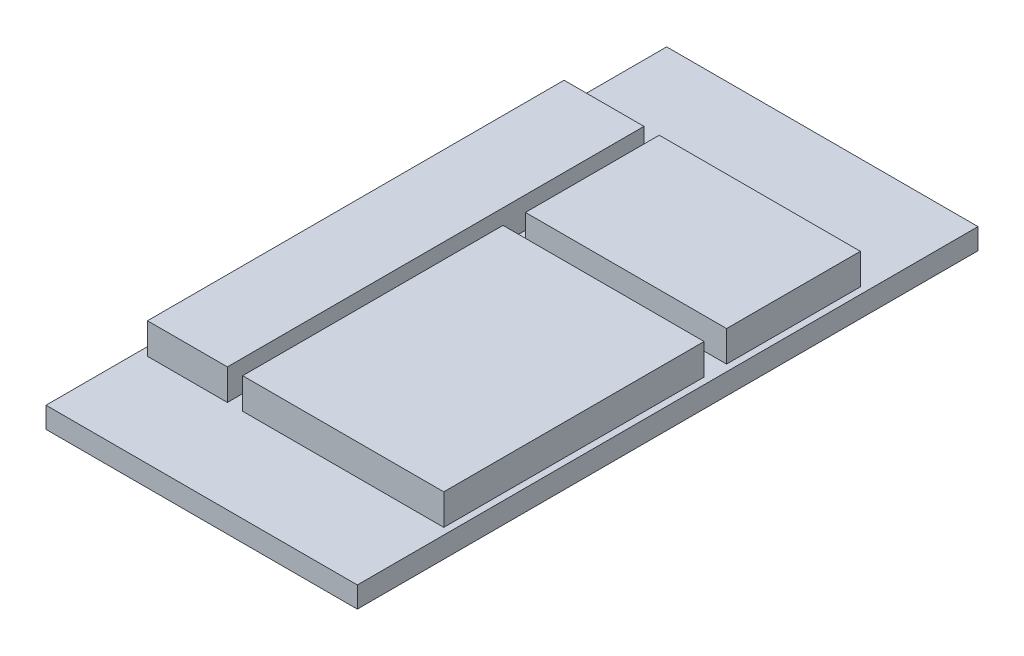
from build123d import *

# Parameters (mm, degrees)
SKETCH1_W           = 23.75
SKETCH1_H           = 47.35
BOSS_EXTRUDE1_DEPTH = 1.6
SKETCH2_W           = 15.342177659
SKETCH2_H           = 19.862640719
SKETCH2_W_2         = 6.095775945
SKETCH2_H_2         = 31.780225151
SKETCH2_H_3         = 10.205287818
BOSS_EXTRUDE2_DEPTH = 2.35


with BuildPart() as part:
    # Sketch1 → Boss-Extrude1 (new body)
    with BuildSketch(Plane(origin=(0, 0, 0), x_dir=(1, 0, 0), z_dir=(0, 1, 0))):
        with Locations((11.875, 23.675)):
            Rectangle(SKETCH1_W, SKETCH1_H)
    extrude(amount=BOSS_EXTRUDE1_DEPTH)

    # Sketch2 → Boss-Extrude2 (add)
    with BuildSketch(Plane(origin=(0, 1.6, 0), x_dir=(1, 0, 0), z_dir=(0, 1, 0))):
        with Locations((15.573560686, 17.031289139)):
            Rectangle(SKETCH2_W, SKETCH2_H)
        with Locations((3.690222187, 22.990081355)):
            Rectangle(SKETCH2_W_2, SKETCH2_H_2)
        with Locations((15.573560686, 33.777550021)):
            Rectangle(SKETCH2_W, SKETCH2_H_3)
    extrude(amount=BOSS_EXTRUDE2_DEPTH)


solid = part.part
